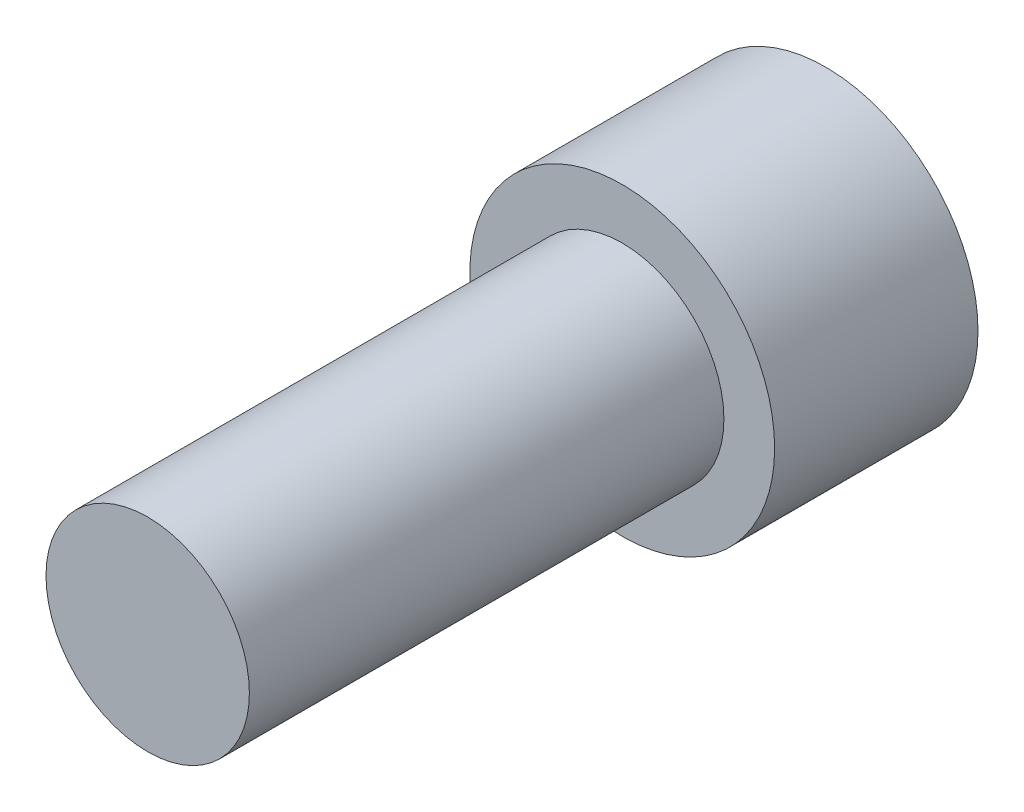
ISO-10303-21;
HEADER;
FILE_DESCRIPTION(('STEP AP214'),'2;1');
FILE_NAME('part.step','',(''),(''),'','','');
FILE_SCHEMA(('AUTOMOTIVE_DESIGN { 1 0 10303 214 1 1 1 1 }'));
ENDSEC;
DATA;
#1=APPLICATION_CONTEXT('core data for automotive mechanical design processes');
#2=APPLICATION_PROTOCOL_DEFINITION('international standard','automotive_design',2000,#1);
#3=PRODUCT_CONTEXT('',#1,'mechanical');
#4=PRODUCT('Part','Part','',(#3));
#5=PRODUCT_RELATED_PRODUCT_CATEGORY('part','',(#4));
#6=PRODUCT_DEFINITION_FORMATION('','',#4);
#7=PRODUCT_DEFINITION_CONTEXT('part definition',#1,'design');
#8=PRODUCT_DEFINITION('design','',#6,#7);
#9=PRODUCT_DEFINITION_SHAPE('','',#8);
#10=(LENGTH_UNIT() NAMED_UNIT(*) SI_UNIT(.MILLI.,.METRE.));
#11=(NAMED_UNIT(*) PLANE_ANGLE_UNIT() SI_UNIT($,.RADIAN.));
#12=(NAMED_UNIT(*) SI_UNIT($,.STERADIAN.) SOLID_ANGLE_UNIT());
#13=UNCERTAINTY_MEASURE_WITH_UNIT(LENGTH_MEASURE(1.E-05),#10,'distance_accuracy_value','');
#14=(GEOMETRIC_REPRESENTATION_CONTEXT(3) GLOBAL_UNCERTAINTY_ASSIGNED_CONTEXT((#13)) GLOBAL_UNIT_ASSIGNED_CONTEXT((#10,
#11,#12)) REPRESENTATION_CONTEXT('',''));
#15=CARTESIAN_POINT('',(0.,0.,0.));
#16=DIRECTION('',(0.,0.,1.));
#17=DIRECTION('',(1.,0.,0.));
#18=AXIS2_PLACEMENT_3D('',#15,#16,#17);
#19=CARTESIAN_POINT('',(0.,0.,22.225));
#20=DIRECTION('',(0.,0.,1.));
#21=DIRECTION('',(1.,0.,0.));
#22=AXIS2_PLACEMENT_3D('',#19,#20,#21);
#23=PLANE('',#22);
#24=CARTESIAN_POINT('',(0.,0.,22.225));
#25=DIRECTION('',(0.,0.,1.));
#26=DIRECTION('',(1.,0.,0.));
#27=AXIS2_PLACEMENT_3D('',#24,#25,#26);
#28=CIRCLE('',#27,4.7625);
#29=CARTESIAN_POINT('',(4.7625,0.,22.225));
#30=VERTEX_POINT('',#29);
#31=EDGE_CURVE('E11',#30,#30,#28,.T.);
#32=ORIENTED_EDGE('',*,*,#31,.T.);
#33=EDGE_LOOP('',(#32));
#34=FACE_BOUND('',#33,.T.);
#35=ADVANCED_FACE('F32',(#34),#23,.T.);
#36=CARTESIAN_POINT('',(0.,0.,22.225));
#37=DIRECTION('',(0.,0.,1.));
#38=DIRECTION('',(1.,0.,0.));
#39=AXIS2_PLACEMENT_3D('',#36,#37,#38);
#40=CYLINDRICAL_SURFACE('',#39,4.7625);
#41=CARTESIAN_POINT('',(0.,0.,0.));
#42=DIRECTION('',(0.,0.,1.));
#43=DIRECTION('',(1.,0.,0.));
#44=AXIS2_PLACEMENT_3D('',#41,#42,#43);
#45=CIRCLE('',#44,4.7625);
#46=CARTESIAN_POINT('',(4.7625,0.,0.));
#47=VERTEX_POINT('',#46);
#48=EDGE_CURVE('E39',#47,#47,#45,.T.);
#49=ORIENTED_EDGE('',*,*,#48,.T.);
#50=EDGE_LOOP('',(#49));
#51=FACE_BOUND('',#50,.T.);
#52=ORIENTED_EDGE('',*,*,#31,.F.);
#53=EDGE_LOOP('',(#52));
#54=FACE_BOUND('',#53,.T.);
#55=ADVANCED_FACE('F146',(#51,#54),#40,.T.);
#56=CARTESIAN_POINT('',(0.,-4.7625,0.));
#57=DIRECTION('',(0.,0.,1.));
#58=DIRECTION('',(1.,0.,0.));
#59=AXIS2_PLACEMENT_3D('',#56,#57,#58);
#60=PLANE('',#59);
#61=CARTESIAN_POINT('',(0.,0.,0.));
#62=DIRECTION('',(0.,0.,1.));
#63=DIRECTION('',(1.,0.,0.));
#64=AXIS2_PLACEMENT_3D('',#61,#62,#63);
#65=CIRCLE('',#64,7.1374);
#66=CARTESIAN_POINT('',(7.1374,0.,0.));
#67=VERTEX_POINT('',#66);
#68=EDGE_CURVE('E141',#67,#67,#65,.T.);
#69=ORIENTED_EDGE('',*,*,#68,.T.);
#70=EDGE_LOOP('',(#69));
#71=FACE_BOUND('',#70,.T.);
#72=ORIENTED_EDGE('',*,*,#48,.F.);
#73=EDGE_LOOP('',(#72));
#74=FACE_BOUND('',#73,.T.);
#75=ADVANCED_FACE('F149',(#71,#74),#60,.T.);
#76=CARTESIAN_POINT('',(0.,0.,22.225));
#77=DIRECTION('',(0.,0.,1.));
#78=DIRECTION('',(1.,0.,0.));
#79=AXIS2_PLACEMENT_3D('',#76,#77,#78);
#80=CYLINDRICAL_SURFACE('',#79,7.1374);
#81=CARTESIAN_POINT('',(0.,0.,-9.525));
#82=DIRECTION('',(0.,0.,1.));
#83=DIRECTION('',(1.,0.,0.));
#84=AXIS2_PLACEMENT_3D('',#81,#82,#83);
#85=CIRCLE('',#84,7.1374);
#86=CARTESIAN_POINT('',(7.1374,0.,-9.525));
#87=VERTEX_POINT('',#86);
#88=EDGE_CURVE('E133',#87,#87,#85,.T.);
#89=ORIENTED_EDGE('',*,*,#88,.T.);
#90=EDGE_LOOP('',(#89));
#91=FACE_BOUND('',#90,.T.);
#92=ORIENTED_EDGE('',*,*,#68,.F.);
#93=EDGE_LOOP('',(#92));
#94=FACE_BOUND('',#93,.T.);
#95=ADVANCED_FACE('F151',(#91,#94),#80,.T.);
#96=CARTESIAN_POINT('',(0.,-7.1374,-9.525));
#97=DIRECTION('',(0.,0.,-1.));
#98=DIRECTION('',(-1.,0.,0.));
#99=AXIS2_PLACEMENT_3D('',#96,#97,#98);
#100=PLANE('',#99);
#101=DIRECTION('',(0.866025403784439,-0.5,0.));
#102=VECTOR('',#101,1.);
#103=CARTESIAN_POINT('',(0.,4.57538541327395,-9.525));
#104=LINE('',#103,#102);
#105=CARTESIAN_POINT('',(0.,4.57538541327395,-9.525));
#106=VERTEX_POINT('',#105);
#107=CARTESIAN_POINT('',(3.9624,2.28769270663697,-9.525));
#108=VERTEX_POINT('',#107);
#109=EDGE_CURVE('E46',#106,#108,#104,.T.);
#110=ORIENTED_EDGE('',*,*,#109,.F.);
#111=DIRECTION('',(0.866025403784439,0.5,0.));
#112=VECTOR('',#111,1.);
#113=CARTESIAN_POINT('',(-3.9624,2.28769270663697,-9.525));
#114=LINE('',#113,#112);
#115=CARTESIAN_POINT('',(-3.9624,2.28769270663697,-9.525));
#116=VERTEX_POINT('',#115);
#117=EDGE_CURVE('E129',#116,#106,#114,.T.);
#118=ORIENTED_EDGE('',*,*,#117,.F.);
#119=DIRECTION('',(0.,1.,0.));
#120=VECTOR('',#119,1.);
#121=CARTESIAN_POINT('',(-3.9624,-2.28769270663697,-9.525));
#122=LINE('',#121,#120);
#123=CARTESIAN_POINT('',(-3.9624,-2.28769270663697,-9.525));
#124=VERTEX_POINT('',#123);
#125=EDGE_CURVE('E127',#124,#116,#122,.T.);
#126=ORIENTED_EDGE('',*,*,#125,.F.);
#127=DIRECTION('',(-0.866025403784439,0.5,0.));
#128=VECTOR('',#127,1.);
#129=CARTESIAN_POINT('',(0.,-4.57538541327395,-9.525));
#130=LINE('',#129,#128);
#131=CARTESIAN_POINT('',(0.,-4.57538541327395,-9.525));
#132=VERTEX_POINT('',#131);
#133=EDGE_CURVE('E94',#132,#124,#130,.T.);
#134=ORIENTED_EDGE('',*,*,#133,.F.);
#135=DIRECTION('',(-0.866025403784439,-0.5,0.));
#136=VECTOR('',#135,1.);
#137=CARTESIAN_POINT('',(3.9624,-2.28769270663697,-9.525));
#138=LINE('',#137,#136);
#139=CARTESIAN_POINT('',(3.9624,-2.28769270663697,-9.525));
#140=VERTEX_POINT('',#139);
#141=EDGE_CURVE('E123',#140,#132,#138,.T.);
#142=ORIENTED_EDGE('',*,*,#141,.F.);
#143=DIRECTION('',(0.,-1.,0.));
#144=VECTOR('',#143,1.);
#145=CARTESIAN_POINT('',(3.9624,2.28769270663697,-9.525));
#146=LINE('',#145,#144);
#147=EDGE_CURVE('E120',#108,#140,#146,.T.);
#148=ORIENTED_EDGE('',*,*,#147,.F.);
#149=EDGE_LOOP('',(#110,#118,#126,#134,#142,#148));
#150=FACE_BOUND('',#149,.T.);
#151=ORIENTED_EDGE('',*,*,#88,.F.);
#152=EDGE_LOOP('',(#151));
#153=FACE_BOUND('',#152,.T.);
#154=ADVANCED_FACE('F158',(#150,#153),#100,.T.);
#155=CARTESIAN_POINT('',(0.,4.57538541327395,-3.683));
#156=DIRECTION('',(0.5,0.866025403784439,0.));
#157=DIRECTION('',(-0.866025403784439,0.5,0.));
#158=AXIS2_PLACEMENT_3D('',#155,#156,#157);
#159=PLANE('',#158);
#160=ORIENTED_EDGE('',*,*,#109,.T.);
#161=DIRECTION('',(0.,0.,-1.));
#162=VECTOR('',#161,1.);
#163=CARTESIAN_POINT('',(3.9624,2.28769270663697,-3.683));
#164=LINE('',#163,#162);
#165=CARTESIAN_POINT('',(3.9624,2.28769270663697,-3.683));
#166=VERTEX_POINT('',#165);
#167=EDGE_CURVE('E76',#166,#108,#164,.T.);
#168=ORIENTED_EDGE('',*,*,#167,.F.);
#169=DIRECTION('',(0.866025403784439,-0.5,0.));
#170=VECTOR('',#169,1.);
#171=CARTESIAN_POINT('',(0.,4.57538541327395,-3.683));
#172=LINE('',#171,#170);
#173=CARTESIAN_POINT('',(0.,4.57538541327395,-3.683));
#174=VERTEX_POINT('',#173);
#175=EDGE_CURVE('E131',#174,#166,#172,.T.);
#176=ORIENTED_EDGE('',*,*,#175,.F.);
#177=DIRECTION('',(0.,0.,-1.));
#178=VECTOR('',#177,1.);
#179=CARTESIAN_POINT('',(0.,4.57538541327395,-3.683));
#180=LINE('',#179,#178);
#181=EDGE_CURVE('E54',#174,#106,#180,.T.);
#182=ORIENTED_EDGE('',*,*,#181,.T.);
#183=EDGE_LOOP('',(#160,#168,#176,#182));
#184=FACE_BOUND('',#183,.T.);
#185=ADVANCED_FACE('F189',(#184),#159,.F.);
#186=CARTESIAN_POINT('',(-3.9624,2.28769270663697,-3.683));
#187=DIRECTION('',(-0.5,0.866025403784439,0.));
#188=DIRECTION('',(-0.866025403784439,-0.5,0.));
#189=AXIS2_PLACEMENT_3D('',#186,#187,#188);
#190=PLANE('',#189);
#191=ORIENTED_EDGE('',*,*,#117,.T.);
#192=ORIENTED_EDGE('',*,*,#181,.F.);
#193=DIRECTION('',(0.866025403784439,0.5,0.));
#194=VECTOR('',#193,1.);
#195=CARTESIAN_POINT('',(-3.9624,2.28769270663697,-3.683));
#196=LINE('',#195,#194);
#197=CARTESIAN_POINT('',(-3.9624,2.28769270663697,-3.683));
#198=VERTEX_POINT('',#197);
#199=EDGE_CURVE('E106',#198,#174,#196,.T.);
#200=ORIENTED_EDGE('',*,*,#199,.F.);
#201=DIRECTION('',(0.,0.,-1.));
#202=VECTOR('',#201,1.);
#203=CARTESIAN_POINT('',(-3.9624,2.28769270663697,-3.683));
#204=LINE('',#203,#202);
#205=EDGE_CURVE('E98',#198,#116,#204,.T.);
#206=ORIENTED_EDGE('',*,*,#205,.T.);
#207=EDGE_LOOP('',(#191,#192,#200,#206));
#208=FACE_BOUND('',#207,.T.);
#209=ADVANCED_FACE('F199',(#208),#190,.F.);
#210=CARTESIAN_POINT('',(-3.9624,-2.28769270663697,-3.683));
#211=DIRECTION('',(-1.,0.,0.));
#212=DIRECTION('',(0.,0.,1.));
#213=AXIS2_PLACEMENT_3D('',#210,#211,#212);
#214=PLANE('',#213);
#215=ORIENTED_EDGE('',*,*,#125,.T.);
#216=ORIENTED_EDGE('',*,*,#205,.F.);
#217=DIRECTION('',(0.,1.,0.));
#218=VECTOR('',#217,1.);
#219=CARTESIAN_POINT('',(-3.9624,-2.28769270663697,-3.683));
#220=LINE('',#219,#218);
#221=CARTESIAN_POINT('',(-3.9624,-2.28769270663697,-3.683));
#222=VERTEX_POINT('',#221);
#223=EDGE_CURVE('E102',#222,#198,#220,.T.);
#224=ORIENTED_EDGE('',*,*,#223,.F.);
#225=DIRECTION('',(0.,0.,-1.));
#226=VECTOR('',#225,1.);
#227=CARTESIAN_POINT('',(-3.9624,-2.28769270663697,-3.683));
#228=LINE('',#227,#226);
#229=EDGE_CURVE('E87',#222,#124,#228,.T.);
#230=ORIENTED_EDGE('',*,*,#229,.T.);
#231=EDGE_LOOP('',(#215,#216,#224,#230));
#232=FACE_BOUND('',#231,.T.);
#233=ADVANCED_FACE('F103',(#232),#214,.F.);
#234=CARTESIAN_POINT('',(0.,-4.57538541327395,-3.683));
#235=DIRECTION('',(-0.5,-0.866025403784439,0.));
#236=DIRECTION('',(0.866025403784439,-0.5,0.));
#237=AXIS2_PLACEMENT_3D('',#234,#235,#236);
#238=PLANE('',#237);
#239=ORIENTED_EDGE('',*,*,#133,.T.);
#240=ORIENTED_EDGE('',*,*,#229,.F.);
#241=DIRECTION('',(-0.866025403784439,0.5,0.));
#242=VECTOR('',#241,1.);
#243=CARTESIAN_POINT('',(0.,-4.57538541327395,-3.683));
#244=LINE('',#243,#242);
#245=CARTESIAN_POINT('',(0.,-4.57538541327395,-3.683));
#246=VERTEX_POINT('',#245);
#247=EDGE_CURVE('E91',#246,#222,#244,.T.);
#248=ORIENTED_EDGE('',*,*,#247,.F.);
#249=DIRECTION('',(0.,0.,-1.));
#250=VECTOR('',#249,1.);
#251=CARTESIAN_POINT('',(0.,-4.57538541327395,-3.683));
#252=LINE('',#251,#250);
#253=EDGE_CURVE('E99',#246,#132,#252,.T.);
#254=ORIENTED_EDGE('',*,*,#253,.T.);
#255=EDGE_LOOP('',(#239,#240,#248,#254));
#256=FACE_BOUND('',#255,.T.);
#257=ADVANCED_FACE('F89',(#256),#238,.F.);
#258=CARTESIAN_POINT('',(3.9624,-2.28769270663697,-3.683));
#259=DIRECTION('',(0.5,-0.866025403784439,0.));
#260=DIRECTION('',(0.866025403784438,0.5,0.));
#261=AXIS2_PLACEMENT_3D('',#258,#259,#260);
#262=PLANE('',#261);
#263=ORIENTED_EDGE('',*,*,#141,.T.);
#264=ORIENTED_EDGE('',*,*,#253,.F.);
#265=DIRECTION('',(-0.866025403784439,-0.5,0.));
#266=VECTOR('',#265,1.);
#267=CARTESIAN_POINT('',(3.9624,-2.28769270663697,-3.683));
#268=LINE('',#267,#266);
#269=CARTESIAN_POINT('',(3.9624,-2.28769270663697,-3.683));
#270=VERTEX_POINT('',#269);
#271=EDGE_CURVE('E112',#270,#246,#268,.T.);
#272=ORIENTED_EDGE('',*,*,#271,.F.);
#273=DIRECTION('',(0.,0.,-1.));
#274=VECTOR('',#273,1.);
#275=CARTESIAN_POINT('',(3.9624,-2.28769270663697,-3.683));
#276=LINE('',#275,#274);
#277=EDGE_CURVE('E136',#270,#140,#276,.T.);
#278=ORIENTED_EDGE('',*,*,#277,.T.);
#279=EDGE_LOOP('',(#263,#264,#272,#278));
#280=FACE_BOUND('',#279,.T.);
#281=ADVANCED_FACE('F224',(#280),#262,.F.);
#282=CARTESIAN_POINT('',(3.9624,2.28769270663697,-3.683));
#283=DIRECTION('',(1.,0.,0.));
#284=DIRECTION('',(0.,0.,-1.));
#285=AXIS2_PLACEMENT_3D('',#282,#283,#284);
#286=PLANE('',#285);
#287=ORIENTED_EDGE('',*,*,#147,.T.);
#288=ORIENTED_EDGE('',*,*,#277,.F.);
#289=DIRECTION('',(0.,-1.,0.));
#290=VECTOR('',#289,1.);
#291=CARTESIAN_POINT('',(3.9624,2.28769270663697,-3.683));
#292=LINE('',#291,#290);
#293=EDGE_CURVE('E114',#166,#270,#292,.T.);
#294=ORIENTED_EDGE('',*,*,#293,.F.);
#295=ORIENTED_EDGE('',*,*,#167,.T.);
#296=EDGE_LOOP('',(#287,#288,#294,#295));
#297=FACE_BOUND('',#296,.T.);
#298=ADVANCED_FACE('F233',(#297),#286,.F.);
#299=CARTESIAN_POINT('',(7.9248,0.,-3.683));
#300=DIRECTION('',(0.,0.,-1.));
#301=DIRECTION('',(-1.,0.,0.));
#302=AXIS2_PLACEMENT_3D('',#299,#300,#301);
#303=PLANE('',#302);
#304=ORIENTED_EDGE('',*,*,#175,.T.);
#305=ORIENTED_EDGE('',*,*,#293,.T.);
#306=ORIENTED_EDGE('',*,*,#271,.T.);
#307=ORIENTED_EDGE('',*,*,#247,.T.);
#308=ORIENTED_EDGE('',*,*,#223,.T.);
#309=ORIENTED_EDGE('',*,*,#199,.T.);
#310=EDGE_LOOP('',(#304,#305,#306,#307,#308,#309));
#311=FACE_BOUND('',#310,.T.);
#312=ADVANCED_FACE('F109',(#311),#303,.T.);
#313=CLOSED_SHELL('',(#35,#55,#75,#95,#154,#185,#209,#233,#257,#281,#298,#312));
#314=MANIFOLD_SOLID_BREP('B2',#313);
#315=ADVANCED_BREP_SHAPE_REPRESENTATION('',(#18,#314),#14);
#316=SHAPE_DEFINITION_REPRESENTATION(#9,#315);
ENDSEC;
END-ISO-10303-21;
